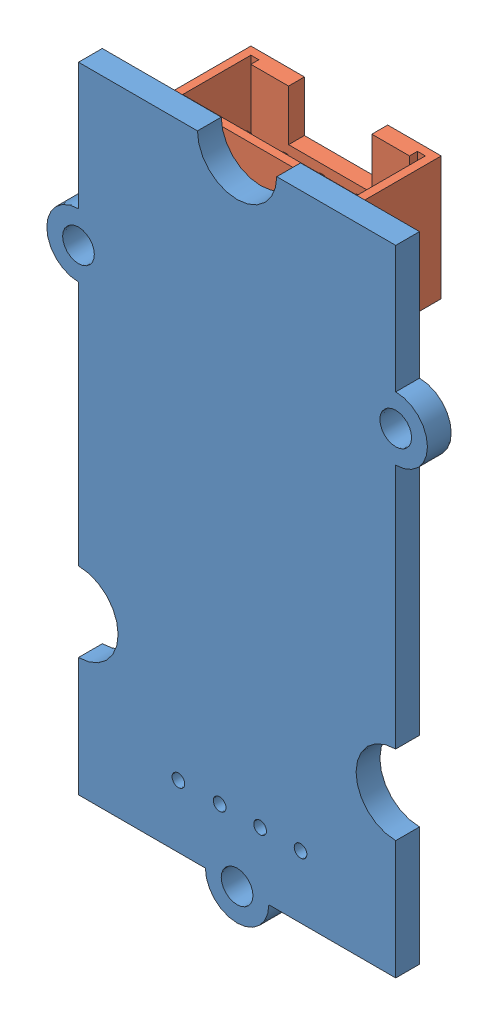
SolidWorks assembly Grove IMU.SLDASM, configuration Défaut (file format 7000). Lengths in mm.
Overall size (24 42 6.8).
3 component instances, 3 part files, 3 mates.
Components (placement in the parent):
- Grove IMU Board-1: Grove IMU Board.SLDPRT [Défaut] at (-2.3952 -22.0212 41.25) size (24 42 1.5)
- Grove Connecteur-1: Grove Connecteur.SLDPRT [Défaut] at (-2.3266 18.9464 42) x (0 -1 0) z (1 0 0) size (7.8 5.3 12)
- MPU9150-1: MPU9150.SLDPRT [Défaut] at (-3.0078 -7.8003 40.45) size (4 4 0.8)
Mates (geometry in assembly coordinates):
- Coïncidente1: coincident anti-aligned: plane of Grove IMU Board-1 through (-12.3952 -12.0212 41.25) normal (0 0 -1); plane of Grove Connecteur-1 through (-2.3266 18.9464 41.25) normal (0 0 1)
- Parallèle2: parallel anti-aligned: line of Grove IMU Board-1 through (7.6048 9.9788 41.25) axis (0 1 0); line of Grove Connecteur-1 through (3.6734 17.4964 41.25) axis (0 -1 0)
- Coïncidente2: coincident anti-aligned: plane of Grove IMU Board-1 through (-12.3952 -12.0212 41.25) normal (0 0 -1); plane of MPU9150-1 through (-3.0078 -7.8003 41.25) normal (0 0 1)
